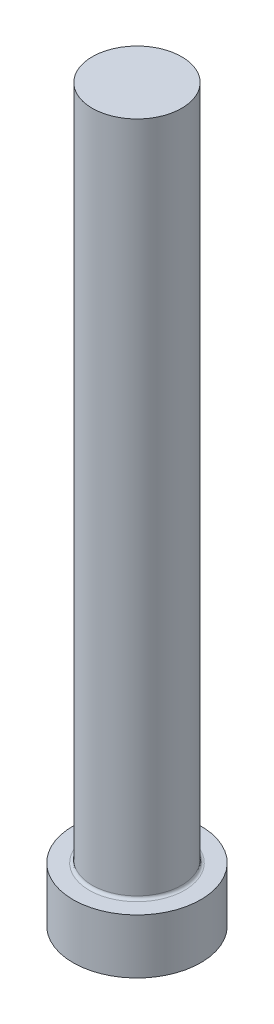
ISO-10303-21;
HEADER;
FILE_DESCRIPTION(('STEP AP214'),'2;1');
FILE_NAME('part.step','',(''),(''),'','','');
FILE_SCHEMA(('AUTOMOTIVE_DESIGN { 1 0 10303 214 1 1 1 1 }'));
ENDSEC;
DATA;
#1=APPLICATION_CONTEXT('core data for automotive mechanical design processes');
#2=APPLICATION_PROTOCOL_DEFINITION('international standard','automotive_design',2000,#1);
#3=PRODUCT_CONTEXT('',#1,'mechanical');
#4=PRODUCT('Part','Part','',(#3));
#5=PRODUCT_RELATED_PRODUCT_CATEGORY('part','',(#4));
#6=PRODUCT_DEFINITION_FORMATION('','',#4);
#7=PRODUCT_DEFINITION_CONTEXT('part definition',#1,'design');
#8=PRODUCT_DEFINITION('design','',#6,#7);
#9=PRODUCT_DEFINITION_SHAPE('','',#8);
#10=(LENGTH_UNIT() NAMED_UNIT(*) SI_UNIT(.MILLI.,.METRE.));
#11=(NAMED_UNIT(*) PLANE_ANGLE_UNIT() SI_UNIT($,.RADIAN.));
#12=(NAMED_UNIT(*) SI_UNIT($,.STERADIAN.) SOLID_ANGLE_UNIT());
#13=UNCERTAINTY_MEASURE_WITH_UNIT(LENGTH_MEASURE(1.E-05),#10,'distance_accuracy_value','');
#14=(GEOMETRIC_REPRESENTATION_CONTEXT(3) GLOBAL_UNCERTAINTY_ASSIGNED_CONTEXT((#13)) GLOBAL_UNIT_ASSIGNED_CONTEXT((#10,
#11,#12)) REPRESENTATION_CONTEXT('',''));
#15=CARTESIAN_POINT('',(0.,0.,0.));
#16=DIRECTION('',(0.,0.,1.));
#17=DIRECTION('',(1.,0.,0.));
#18=AXIS2_PLACEMENT_3D('',#15,#16,#17);
#19=CARTESIAN_POINT('',(0.,63.5,0.));
#20=DIRECTION('',(0.,-1.,0.));
#21=DIRECTION('',(0.,0.,-1.));
#22=AXIS2_PLACEMENT_3D('',#19,#20,#21);
#23=PLANE('',#22);
#24=CARTESIAN_POINT('',(0.,63.5,0.));
#25=DIRECTION('',(0.,1.,0.));
#26=DIRECTION('',(0.,0.,1.));
#27=AXIS2_PLACEMENT_3D('',#24,#25,#26);
#28=CIRCLE('',#27,3.8862);
#29=CARTESIAN_POINT('',(0.,63.5,3.8862));
#30=VERTEX_POINT('',#29);
#31=EDGE_CURVE('E10',#30,#30,#28,.T.);
#32=ORIENTED_EDGE('',*,*,#31,.T.);
#33=EDGE_LOOP('',(#32));
#34=FACE_BOUND('',#33,.T.);
#35=ADVANCED_FACE('F30',(#34),#23,.F.);
#36=CARTESIAN_POINT('',(0.,0.,0.));
#37=DIRECTION('',(0.,1.,0.));
#38=DIRECTION('',(0.,0.,1.));
#39=AXIS2_PLACEMENT_3D('',#36,#37,#38);
#40=CYLINDRICAL_SURFACE('',#39,3.8862);
#41=ORIENTED_EDGE('',*,*,#31,.F.);
#42=EDGE_LOOP('',(#41));
#43=FACE_BOUND('',#42,.T.);
#44=CARTESIAN_POINT('',(0.,5.0038,0.));
#45=DIRECTION('',(0.,1.,0.));
#46=DIRECTION('',(0.,0.,1.));
#47=AXIS2_PLACEMENT_3D('',#44,#45,#46);
#48=CIRCLE('',#47,3.8862);
#49=CARTESIAN_POINT('',(0.,5.0038,3.8862));
#50=VERTEX_POINT('',#49);
#51=EDGE_CURVE('E36',#50,#50,#48,.T.);
#52=ORIENTED_EDGE('',*,*,#51,.T.);
#53=EDGE_LOOP('',(#52));
#54=FACE_BOUND('',#53,.T.);
#55=ADVANCED_FACE('F65',(#43,#54),#40,.T.);
#56=CARTESIAN_POINT('',(0.,5.0038,0.));
#57=DIRECTION('',(0.,1.,0.));
#58=DIRECTION('',(0.,0.,1.));
#59=AXIS2_PLACEMENT_3D('',#56,#57,#58);
#60=TOROIDAL_SURFACE('',#59,4.1402,0.254);
#61=ORIENTED_EDGE('',*,*,#51,.F.);
#62=EDGE_LOOP('',(#61));
#63=FACE_BOUND('',#62,.T.);
#64=CARTESIAN_POINT('',(0.,4.7498,0.));
#65=DIRECTION('',(0.,1.,0.));
#66=DIRECTION('',(0.,0.,1.));
#67=AXIS2_PLACEMENT_3D('',#64,#65,#66);
#68=CIRCLE('',#67,4.1402);
#69=CARTESIAN_POINT('',(0.,4.7498,4.1402));
#70=VERTEX_POINT('',#69);
#71=EDGE_CURVE('E40',#70,#70,#68,.T.);
#72=ORIENTED_EDGE('',*,*,#71,.T.);
#73=EDGE_LOOP('',(#72));
#74=FACE_BOUND('',#73,.T.);
#75=ADVANCED_FACE('F69',(#63,#74),#60,.F.);
#76=CARTESIAN_POINT('',(5.5499,4.7498,0.));
#77=DIRECTION('',(0.,-1.,0.));
#78=DIRECTION('',(0.,0.,-1.));
#79=AXIS2_PLACEMENT_3D('',#76,#77,#78);
#80=PLANE('',#79);
#81=ORIENTED_EDGE('',*,*,#71,.F.);
#82=EDGE_LOOP('',(#81));
#83=FACE_BOUND('',#82,.T.);
#84=CARTESIAN_POINT('',(0.,4.7498,0.));
#85=DIRECTION('',(0.,1.,0.));
#86=DIRECTION('',(0.,0.,1.));
#87=AXIS2_PLACEMENT_3D('',#84,#85,#86);
#88=CIRCLE('',#87,5.5499);
#89=CARTESIAN_POINT('',(0.,4.7498,5.5499));
#90=VERTEX_POINT('',#89);
#91=EDGE_CURVE('E44',#90,#90,#88,.T.);
#92=ORIENTED_EDGE('',*,*,#91,.T.);
#93=EDGE_LOOP('',(#92));
#94=FACE_BOUND('',#93,.T.);
#95=ADVANCED_FACE('F61',(#83,#94),#80,.F.);
#96=CARTESIAN_POINT('',(0.,0.,0.));
#97=DIRECTION('',(0.,1.,0.));
#98=DIRECTION('',(0.,0.,1.));
#99=AXIS2_PLACEMENT_3D('',#96,#97,#98);
#100=CYLINDRICAL_SURFACE('',#99,5.5499);
#101=ORIENTED_EDGE('',*,*,#91,.F.);
#102=EDGE_LOOP('',(#101));
#103=FACE_BOUND('',#102,.T.);
#104=CARTESIAN_POINT('',(0.,0.,0.));
#105=DIRECTION('',(0.,1.,0.));
#106=DIRECTION('',(0.,0.,1.));
#107=AXIS2_PLACEMENT_3D('',#104,#105,#106);
#108=CIRCLE('',#107,5.5499);
#109=CARTESIAN_POINT('',(0.,0.,5.5499));
#110=VERTEX_POINT('',#109);
#111=EDGE_CURVE('E49',#110,#110,#108,.T.);
#112=ORIENTED_EDGE('',*,*,#111,.T.);
#113=EDGE_LOOP('',(#112));
#114=FACE_BOUND('',#113,.T.);
#115=ADVANCED_FACE('F53',(#103,#114),#100,.T.);
#116=CARTESIAN_POINT('',(0.,0.,0.));
#117=DIRECTION('',(0.,1.,0.));
#118=DIRECTION('',(0.,0.,1.));
#119=AXIS2_PLACEMENT_3D('',#116,#117,#118);
#120=PLANE('',#119);
#121=ORIENTED_EDGE('',*,*,#111,.F.);
#122=EDGE_LOOP('',(#121));
#123=FACE_BOUND('',#122,.T.);
#124=ADVANCED_FACE('F55',(#123),#120,.F.);
#125=CLOSED_SHELL('',(#35,#55,#75,#95,#115,#124));
#126=MANIFOLD_SOLID_BREP('B2',#125);
#127=ADVANCED_BREP_SHAPE_REPRESENTATION('',(#18,#126),#14);
#128=SHAPE_DEFINITION_REPRESENTATION(#9,#127);
ENDSEC;
END-ISO-10303-21;
